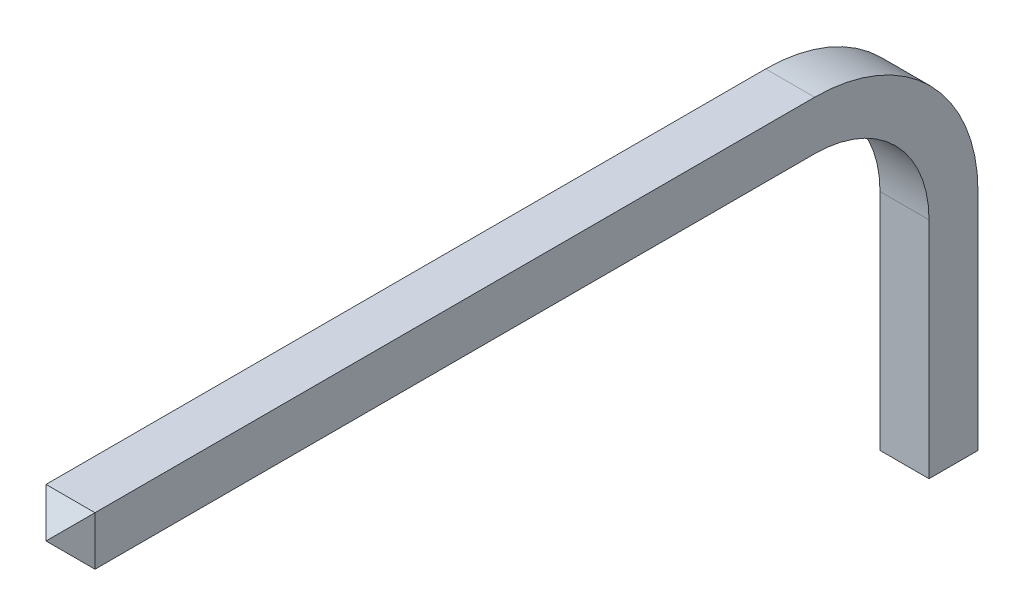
ISO-10303-21;
HEADER;
FILE_DESCRIPTION(('STEP AP214'),'2;1');
FILE_NAME('part.step','',(''),(''),'','','');
FILE_SCHEMA(('AUTOMOTIVE_DESIGN { 1 0 10303 214 1 1 1 1 }'));
ENDSEC;
DATA;
#1=APPLICATION_CONTEXT('core data for automotive mechanical design processes');
#2=APPLICATION_PROTOCOL_DEFINITION('international standard','automotive_design',2000,#1);
#3=PRODUCT_CONTEXT('',#1,'mechanical');
#4=PRODUCT('Part','Part','',(#3));
#5=PRODUCT_RELATED_PRODUCT_CATEGORY('part','',(#4));
#6=PRODUCT_DEFINITION_FORMATION('','',#4);
#7=PRODUCT_DEFINITION_CONTEXT('part definition',#1,'design');
#8=PRODUCT_DEFINITION('design','',#6,#7);
#9=PRODUCT_DEFINITION_SHAPE('','',#8);
#10=(LENGTH_UNIT() NAMED_UNIT(*) SI_UNIT(.MILLI.,.METRE.));
#11=(NAMED_UNIT(*) PLANE_ANGLE_UNIT() SI_UNIT($,.RADIAN.));
#12=(NAMED_UNIT(*) SI_UNIT($,.STERADIAN.) SOLID_ANGLE_UNIT());
#13=UNCERTAINTY_MEASURE_WITH_UNIT(LENGTH_MEASURE(1.E-05),#10,'distance_accuracy_value','');
#14=(GEOMETRIC_REPRESENTATION_CONTEXT(3) GLOBAL_UNCERTAINTY_ASSIGNED_CONTEXT((#13)) GLOBAL_UNIT_ASSIGNED_CONTEXT((#10,
#11,#12)) REPRESENTATION_CONTEXT('',''));
#15=CARTESIAN_POINT('',(0.,0.,0.));
#16=DIRECTION('',(0.,0.,1.));
#17=DIRECTION('',(1.,0.,0.));
#18=AXIS2_PLACEMENT_3D('',#15,#16,#17);
#19=CARTESIAN_POINT('',(0.5715,9.0424,3.81000000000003));
#20=DIRECTION('',(0.,-1.,0.));
#21=DIRECTION('',(0.,0.,-1.));
#22=AXIS2_PLACEMENT_3D('',#19,#20,#21);
#23=PLANE('',#22);
#24=DIRECTION('',(0.,0.,1.));
#25=VECTOR('',#24,1.);
#26=CARTESIAN_POINT('',(-0.5715,9.0424,3.81000000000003));
#27=LINE('',#26,#25);
#28=CARTESIAN_POINT('',(-0.5715,9.0424,3.81000000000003));
#29=VERTEX_POINT('',#28);
#30=CARTESIAN_POINT('',(-0.5715,9.0424,20.5994));
#31=VERTEX_POINT('',#30);
#32=EDGE_CURVE('E179',#29,#31,#27,.T.);
#33=ORIENTED_EDGE('',*,*,#32,.T.);
#34=DIRECTION('',(-1.,0.,0.));
#35=VECTOR('',#34,1.);
#36=CARTESIAN_POINT('',(0.5715,9.0424,20.5994));
#37=LINE('',#36,#35);
#38=CARTESIAN_POINT('',(0.5715,9.0424,20.5994));
#39=VERTEX_POINT('',#38);
#40=EDGE_CURVE('E11',#39,#31,#37,.T.);
#41=ORIENTED_EDGE('',*,*,#40,.F.);
#42=DIRECTION('',(0.,0.,1.));
#43=VECTOR('',#42,1.);
#44=CARTESIAN_POINT('',(0.5715,9.0424,3.81000000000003));
#45=LINE('',#44,#43);
#46=CARTESIAN_POINT('',(0.5715,9.0424,3.81000000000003));
#47=VERTEX_POINT('',#46);
#48=EDGE_CURVE('E84',#47,#39,#45,.T.);
#49=ORIENTED_EDGE('',*,*,#48,.F.);
#50=DIRECTION('',(-1.,0.,0.));
#51=VECTOR('',#50,1.);
#52=CARTESIAN_POINT('',(0.5715,9.0424,3.81000000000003));
#53=LINE('',#52,#51);
#54=EDGE_CURVE('E136',#47,#29,#53,.T.);
#55=ORIENTED_EDGE('',*,*,#54,.T.);
#56=EDGE_LOOP('',(#33,#41,#49,#55));
#57=FACE_BOUND('',#56,.T.);
#58=ADVANCED_FACE('F33',(#57),#23,.F.);
#59=CARTESIAN_POINT('',(0.5715,7.8994,3.81000000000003));
#60=DIRECTION('',(0.,-1.,0.));
#61=DIRECTION('',(0.,0.,-1.));
#62=AXIS2_PLACEMENT_3D('',#59,#60,#61);
#63=PLANE('',#62);
#64=DIRECTION('',(0.,0.,1.));
#65=VECTOR('',#64,1.);
#66=CARTESIAN_POINT('',(-0.5715,7.8994,3.81000000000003));
#67=LINE('',#66,#65);
#68=CARTESIAN_POINT('',(-0.5715,7.8994,3.81000000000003));
#69=VERTEX_POINT('',#68);
#70=CARTESIAN_POINT('',(-0.5715,7.8994,20.5994));
#71=VERTEX_POINT('',#70);
#72=EDGE_CURVE('E148',#69,#71,#67,.T.);
#73=ORIENTED_EDGE('',*,*,#72,.F.);
#74=DIRECTION('',(-1.,0.,0.));
#75=VECTOR('',#74,1.);
#76=CARTESIAN_POINT('',(0.5715,7.8994,3.81000000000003));
#77=LINE('',#76,#75);
#78=CARTESIAN_POINT('',(0.5715,7.8994,3.81000000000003));
#79=VERTEX_POINT('',#78);
#80=EDGE_CURVE('E141',#79,#69,#77,.T.);
#81=ORIENTED_EDGE('',*,*,#80,.F.);
#82=DIRECTION('',(0.,0.,1.));
#83=VECTOR('',#82,1.);
#84=CARTESIAN_POINT('',(0.5715,7.8994,3.81000000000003));
#85=LINE('',#84,#83);
#86=CARTESIAN_POINT('',(0.5715,7.8994,20.5994));
#87=VERTEX_POINT('',#86);
#88=EDGE_CURVE('E151',#79,#87,#85,.T.);
#89=ORIENTED_EDGE('',*,*,#88,.T.);
#90=DIRECTION('',(-1.,0.,0.));
#91=VECTOR('',#90,1.);
#92=CARTESIAN_POINT('',(0.5715,7.8994,20.5994));
#93=LINE('',#92,#91);
#94=EDGE_CURVE('E41',#87,#71,#93,.T.);
#95=ORIENTED_EDGE('',*,*,#94,.T.);
#96=EDGE_LOOP('',(#73,#81,#89,#95));
#97=FACE_BOUND('',#96,.T.);
#98=ADVANCED_FACE('F147',(#97),#63,.T.);
#99=CARTESIAN_POINT('',(0.5715,5.2324,3.81));
#100=DIRECTION('',(-1.,0.,0.));
#101=DIRECTION('',(0.,0.,1.));
#102=AXIS2_PLACEMENT_3D('',#99,#100,#101);
#103=CYLINDRICAL_SURFACE('',#102,2.667);
#104=CARTESIAN_POINT('',(-0.5715,5.2324,3.81));
#105=DIRECTION('',(1.,0.,0.));
#106=DIRECTION('',(0.,0.,-1.));
#107=AXIS2_PLACEMENT_3D('',#104,#105,#106);
#108=CIRCLE('',#107,2.667);
#109=CARTESIAN_POINT('',(-0.5715,5.23239999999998,1.143));
#110=VERTEX_POINT('',#109);
#111=EDGE_CURVE('E166',#110,#69,#108,.T.);
#112=ORIENTED_EDGE('',*,*,#111,.F.);
#113=DIRECTION('',(-1.,0.,0.));
#114=VECTOR('',#113,1.);
#115=CARTESIAN_POINT('',(0.5715,5.23239999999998,1.143));
#116=LINE('',#115,#114);
#117=CARTESIAN_POINT('',(0.5715,5.23239999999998,1.143));
#118=VERTEX_POINT('',#117);
#119=EDGE_CURVE('E134',#118,#110,#116,.T.);
#120=ORIENTED_EDGE('',*,*,#119,.F.);
#121=CARTESIAN_POINT('',(0.5715,5.2324,3.81));
#122=DIRECTION('',(1.,0.,0.));
#123=DIRECTION('',(0.,0.,-1.));
#124=AXIS2_PLACEMENT_3D('',#121,#122,#123);
#125=CIRCLE('',#124,2.667);
#126=EDGE_CURVE('E194',#118,#79,#125,.T.);
#127=ORIENTED_EDGE('',*,*,#126,.T.);
#128=ORIENTED_EDGE('',*,*,#80,.T.);
#129=EDGE_LOOP('',(#112,#120,#127,#128));
#130=FACE_BOUND('',#129,.T.);
#131=ADVANCED_FACE('F226',(#130),#103,.F.);
#132=CARTESIAN_POINT('',(0.5715,0.,1.143));
#133=DIRECTION('',(0.,0.,1.));
#134=DIRECTION('',(1.,0.,0.));
#135=AXIS2_PLACEMENT_3D('',#132,#133,#134);
#136=PLANE('',#135);
#137=DIRECTION('',(0.,1.,0.));
#138=VECTOR('',#137,1.);
#139=CARTESIAN_POINT('',(-0.5715,0.,1.143));
#140=LINE('',#139,#138);
#141=CARTESIAN_POINT('',(-0.5715,0.,1.143));
#142=VERTEX_POINT('',#141);
#143=EDGE_CURVE('E185',#142,#110,#140,.T.);
#144=ORIENTED_EDGE('',*,*,#143,.F.);
#145=DIRECTION('',(-1.,0.,0.));
#146=VECTOR('',#145,1.);
#147=CARTESIAN_POINT('',(0.5715,0.,1.143));
#148=LINE('',#147,#146);
#149=CARTESIAN_POINT('',(0.5715,0.,1.143));
#150=VERTEX_POINT('',#149);
#151=EDGE_CURVE('E131',#150,#142,#148,.T.);
#152=ORIENTED_EDGE('',*,*,#151,.F.);
#153=DIRECTION('',(0.,1.,0.));
#154=VECTOR('',#153,1.);
#155=CARTESIAN_POINT('',(0.5715,0.,1.143));
#156=LINE('',#155,#154);
#157=EDGE_CURVE('E113',#150,#118,#156,.T.);
#158=ORIENTED_EDGE('',*,*,#157,.T.);
#159=ORIENTED_EDGE('',*,*,#119,.T.);
#160=EDGE_LOOP('',(#144,#152,#158,#159));
#161=FACE_BOUND('',#160,.T.);
#162=ADVANCED_FACE('F219',(#161),#136,.T.);
#163=CARTESIAN_POINT('',(0.5715,0.,0.));
#164=DIRECTION('',(0.,0.,1.));
#165=DIRECTION('',(1.,0.,0.));
#166=AXIS2_PLACEMENT_3D('',#163,#164,#165);
#167=PLANE('',#166);
#168=DIRECTION('',(0.,1.,0.));
#169=VECTOR('',#168,1.);
#170=CARTESIAN_POINT('',(-0.5715,0.,0.));
#171=LINE('',#170,#169);
#172=CARTESIAN_POINT('',(-0.5715,0.,0.));
#173=VERTEX_POINT('',#172);
#174=CARTESIAN_POINT('',(-0.5715,5.23239999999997,0.));
#175=VERTEX_POINT('',#174);
#176=EDGE_CURVE('E72',#173,#175,#171,.T.);
#177=ORIENTED_EDGE('',*,*,#176,.T.);
#178=DIRECTION('',(-1.,0.,0.));
#179=VECTOR('',#178,1.);
#180=CARTESIAN_POINT('',(0.5715,5.23239999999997,0.));
#181=LINE('',#180,#179);
#182=CARTESIAN_POINT('',(0.5715,5.23239999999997,0.));
#183=VERTEX_POINT('',#182);
#184=EDGE_CURVE('E104',#183,#175,#181,.T.);
#185=ORIENTED_EDGE('',*,*,#184,.F.);
#186=DIRECTION('',(0.,1.,0.));
#187=VECTOR('',#186,1.);
#188=CARTESIAN_POINT('',(0.5715,0.,0.));
#189=LINE('',#188,#187);
#190=CARTESIAN_POINT('',(0.5715,0.,0.));
#191=VERTEX_POINT('',#190);
#192=EDGE_CURVE('E99',#191,#183,#189,.T.);
#193=ORIENTED_EDGE('',*,*,#192,.F.);
#194=DIRECTION('',(-1.,0.,0.));
#195=VECTOR('',#194,1.);
#196=CARTESIAN_POINT('',(0.5715,0.,0.));
#197=LINE('',#196,#195);
#198=EDGE_CURVE('E103',#191,#173,#197,.T.);
#199=ORIENTED_EDGE('',*,*,#198,.T.);
#200=EDGE_LOOP('',(#177,#185,#193,#199));
#201=FACE_BOUND('',#200,.T.);
#202=ADVANCED_FACE('F101',(#201),#167,.F.);
#203=CARTESIAN_POINT('',(0.5715,5.2324,3.81));
#204=DIRECTION('',(-1.,0.,0.));
#205=DIRECTION('',(0.,0.,1.));
#206=AXIS2_PLACEMENT_3D('',#203,#204,#205);
#207=CYLINDRICAL_SURFACE('',#206,3.81);
#208=CARTESIAN_POINT('',(-0.5715,5.2324,3.81));
#209=DIRECTION('',(1.,0.,0.));
#210=DIRECTION('',(0.,0.,-1.));
#211=AXIS2_PLACEMENT_3D('',#208,#209,#210);
#212=CIRCLE('',#211,3.81);
#213=EDGE_CURVE('E78',#175,#29,#212,.T.);
#214=ORIENTED_EDGE('',*,*,#213,.T.);
#215=ORIENTED_EDGE('',*,*,#54,.F.);
#216=CARTESIAN_POINT('',(0.5715,5.2324,3.81));
#217=DIRECTION('',(1.,0.,0.));
#218=DIRECTION('',(0.,0.,-1.));
#219=AXIS2_PLACEMENT_3D('',#216,#217,#218);
#220=CIRCLE('',#219,3.81);
#221=EDGE_CURVE('E49',#183,#47,#220,.T.);
#222=ORIENTED_EDGE('',*,*,#221,.F.);
#223=ORIENTED_EDGE('',*,*,#184,.T.);
#224=EDGE_LOOP('',(#214,#215,#222,#223));
#225=FACE_BOUND('',#224,.T.);
#226=ADVANCED_FACE('F294',(#225),#207,.T.);
#227=CARTESIAN_POINT('',(0.5715,5.2324,3.81));
#228=DIRECTION('',(1.,0.,0.));
#229=DIRECTION('',(0.,0.,-1.));
#230=AXIS2_PLACEMENT_3D('',#227,#228,#229);
#231=PLANE('',#230);
#232=ORIENTED_EDGE('',*,*,#48,.T.);
#233=DIRECTION('',(0.,1.,0.));
#234=VECTOR('',#233,1.);
#235=CARTESIAN_POINT('',(0.5715,7.8994,20.5994));
#236=LINE('',#235,#234);
#237=EDGE_CURVE('E198',#87,#39,#236,.T.);
#238=ORIENTED_EDGE('',*,*,#237,.F.);
#239=ORIENTED_EDGE('',*,*,#88,.F.);
#240=ORIENTED_EDGE('',*,*,#126,.F.);
#241=ORIENTED_EDGE('',*,*,#157,.F.);
#242=DIRECTION('',(0.,0.,1.));
#243=VECTOR('',#242,1.);
#244=CARTESIAN_POINT('',(0.5715,0.,0.));
#245=LINE('',#244,#243);
#246=EDGE_CURVE('E105',#191,#150,#245,.T.);
#247=ORIENTED_EDGE('',*,*,#246,.F.);
#248=ORIENTED_EDGE('',*,*,#192,.T.);
#249=ORIENTED_EDGE('',*,*,#221,.T.);
#250=EDGE_LOOP('',(#232,#238,#239,#240,#241,#247,#248,#249));
#251=FACE_BOUND('',#250,.T.);
#252=ADVANCED_FACE('F110',(#251),#231,.T.);
#253=CARTESIAN_POINT('',(-0.5715,5.2324,3.81));
#254=DIRECTION('',(1.,0.,0.));
#255=DIRECTION('',(0.,0.,-1.));
#256=AXIS2_PLACEMENT_3D('',#253,#254,#255);
#257=PLANE('',#256);
#258=ORIENTED_EDGE('',*,*,#32,.F.);
#259=ORIENTED_EDGE('',*,*,#213,.F.);
#260=ORIENTED_EDGE('',*,*,#176,.F.);
#261=DIRECTION('',(0.,0.,1.));
#262=VECTOR('',#261,1.);
#263=CARTESIAN_POINT('',(-0.5715,0.,0.));
#264=LINE('',#263,#262);
#265=EDGE_CURVE('E187',#173,#142,#264,.T.);
#266=ORIENTED_EDGE('',*,*,#265,.T.);
#267=ORIENTED_EDGE('',*,*,#143,.T.);
#268=ORIENTED_EDGE('',*,*,#111,.T.);
#269=ORIENTED_EDGE('',*,*,#72,.T.);
#270=DIRECTION('',(0.,1.,0.));
#271=VECTOR('',#270,1.);
#272=CARTESIAN_POINT('',(-0.5715,7.8994,20.5994));
#273=LINE('',#272,#271);
#274=EDGE_CURVE('E162',#71,#31,#273,.T.);
#275=ORIENTED_EDGE('',*,*,#274,.T.);
#276=EDGE_LOOP('',(#258,#259,#260,#266,#267,#268,#269,#275));
#277=FACE_BOUND('',#276,.T.);
#278=ADVANCED_FACE('F159',(#277),#257,.F.);
#279=CARTESIAN_POINT('',(0.5715,9.0424,20.5994));
#280=DIRECTION('',(0.,0.707106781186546,0.707106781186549));
#281=DIRECTION('',(0.,-0.707106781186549,0.707106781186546));
#282=AXIS2_PLACEMENT_3D('',#279,#280,#281);
#283=PLANE('',#282);
#284=ORIENTED_EDGE('',*,*,#40,.T.);
#285=DIRECTION('',(-0.577350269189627,0.577350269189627,-0.577350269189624));
#286=VECTOR('',#285,1.);
#287=CARTESIAN_POINT('',(-0.5715,9.0424,20.5994));
#288=LINE('',#287,#286);
#289=CARTESIAN_POINT('',(0.,8.4709,21.1709));
#290=VERTEX_POINT('',#289);
#291=EDGE_CURVE('E175',#290,#31,#288,.T.);
#292=ORIENTED_EDGE('',*,*,#291,.F.);
#293=DIRECTION('',(0.577350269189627,0.577350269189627,-0.577350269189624));
#294=VECTOR('',#293,1.);
#295=CARTESIAN_POINT('',(0.5715,9.0424,20.5994));
#296=LINE('',#295,#294);
#297=EDGE_CURVE('E203',#290,#39,#296,.T.);
#298=ORIENTED_EDGE('',*,*,#297,.T.);
#299=EDGE_LOOP('',(#284,#292,#298));
#300=FACE_BOUND('',#299,.T.);
#301=ADVANCED_FACE('F222',(#300),#283,.T.);
#302=CARTESIAN_POINT('',(-0.5715,9.0424,20.5994));
#303=DIRECTION('',(-0.707106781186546,0.,0.707106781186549));
#304=DIRECTION('',(0.707106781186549,0.,0.707106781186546));
#305=AXIS2_PLACEMENT_3D('',#302,#303,#304);
#306=PLANE('',#305);
#307=ORIENTED_EDGE('',*,*,#274,.F.);
#308=DIRECTION('',(-0.577350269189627,-0.577350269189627,-0.577350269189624));
#309=VECTOR('',#308,1.);
#310=CARTESIAN_POINT('',(-0.5715,7.8994,20.5994));
#311=LINE('',#310,#309);
#312=EDGE_CURVE('E169',#290,#71,#311,.T.);
#313=ORIENTED_EDGE('',*,*,#312,.F.);
#314=ORIENTED_EDGE('',*,*,#291,.T.);
#315=EDGE_LOOP('',(#307,#313,#314));
#316=FACE_BOUND('',#315,.T.);
#317=ADVANCED_FACE('F177',(#316),#306,.T.);
#318=CARTESIAN_POINT('',(-0.5715,7.8994,20.5994));
#319=DIRECTION('',(0.,-0.707106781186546,0.707106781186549));
#320=DIRECTION('',(0.,-0.707106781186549,-0.707106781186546));
#321=AXIS2_PLACEMENT_3D('',#318,#319,#320);
#322=PLANE('',#321);
#323=ORIENTED_EDGE('',*,*,#94,.F.);
#324=DIRECTION('',(0.577350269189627,-0.577350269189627,-0.577350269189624));
#325=VECTOR('',#324,1.);
#326=CARTESIAN_POINT('',(0.5715,7.8994,20.5994));
#327=LINE('',#326,#325);
#328=EDGE_CURVE('E171',#290,#87,#327,.T.);
#329=ORIENTED_EDGE('',*,*,#328,.F.);
#330=ORIENTED_EDGE('',*,*,#312,.T.);
#331=EDGE_LOOP('',(#323,#329,#330));
#332=FACE_BOUND('',#331,.T.);
#333=ADVANCED_FACE('F170',(#332),#322,.T.);
#334=CARTESIAN_POINT('',(0.5715,7.8994,20.5994));
#335=DIRECTION('',(0.707106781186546,0.,0.707106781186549));
#336=DIRECTION('',(0.707106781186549,0.,-0.707106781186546));
#337=AXIS2_PLACEMENT_3D('',#334,#335,#336);
#338=PLANE('',#337);
#339=ORIENTED_EDGE('',*,*,#237,.T.);
#340=ORIENTED_EDGE('',*,*,#297,.F.);
#341=ORIENTED_EDGE('',*,*,#328,.T.);
#342=EDGE_LOOP('',(#339,#340,#341));
#343=FACE_BOUND('',#342,.T.);
#344=ADVANCED_FACE('F224',(#343),#338,.T.);
#345=CARTESIAN_POINT('',(0.5715,0.,1.143));
#346=DIRECTION('',(0.,-0.707106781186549,0.707106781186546));
#347=DIRECTION('',(0.,-0.707106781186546,-0.707106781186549));
#348=AXIS2_PLACEMENT_3D('',#345,#346,#347);
#349=PLANE('',#348);
#350=ORIENTED_EDGE('',*,*,#151,.T.);
#351=DIRECTION('',(-0.577350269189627,0.577350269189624,0.577350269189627));
#352=VECTOR('',#351,1.);
#353=CARTESIAN_POINT('',(-0.5715,0.,1.143));
#354=LINE('',#353,#352);
#355=CARTESIAN_POINT('',(0.,-0.571499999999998,0.5715));
#356=VERTEX_POINT('',#355);
#357=EDGE_CURVE('E206',#356,#142,#354,.T.);
#358=ORIENTED_EDGE('',*,*,#357,.F.);
#359=DIRECTION('',(0.577350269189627,0.577350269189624,0.577350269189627));
#360=VECTOR('',#359,1.);
#361=CARTESIAN_POINT('',(0.5715,0.,1.143));
#362=LINE('',#361,#360);
#363=EDGE_CURVE('E122',#356,#150,#362,.T.);
#364=ORIENTED_EDGE('',*,*,#363,.T.);
#365=EDGE_LOOP('',(#350,#358,#364));
#366=FACE_BOUND('',#365,.T.);
#367=ADVANCED_FACE('F216',(#366),#349,.T.);
#368=CARTESIAN_POINT('',(-0.5715,0.,1.143));
#369=DIRECTION('',(-0.707106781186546,-0.707106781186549,0.));
#370=DIRECTION('',(0.707106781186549,-0.707106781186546,0.));
#371=AXIS2_PLACEMENT_3D('',#368,#369,#370);
#372=PLANE('',#371);
#373=ORIENTED_EDGE('',*,*,#265,.F.);
#374=DIRECTION('',(-0.577350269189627,0.577350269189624,-0.577350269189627));
#375=VECTOR('',#374,1.);
#376=CARTESIAN_POINT('',(-0.5715,0.,0.));
#377=LINE('',#376,#375);
#378=EDGE_CURVE('E126',#356,#173,#377,.T.);
#379=ORIENTED_EDGE('',*,*,#378,.F.);
#380=ORIENTED_EDGE('',*,*,#357,.T.);
#381=EDGE_LOOP('',(#373,#379,#380));
#382=FACE_BOUND('',#381,.T.);
#383=ADVANCED_FACE('F213',(#382),#372,.T.);
#384=CARTESIAN_POINT('',(-0.5715,0.,0.));
#385=DIRECTION('',(0.,-0.707106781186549,-0.707106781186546));
#386=DIRECTION('',(0.,0.707106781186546,-0.707106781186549));
#387=AXIS2_PLACEMENT_3D('',#384,#385,#386);
#388=PLANE('',#387);
#389=ORIENTED_EDGE('',*,*,#198,.F.);
#390=DIRECTION('',(0.577350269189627,0.577350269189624,-0.577350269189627));
#391=VECTOR('',#390,1.);
#392=CARTESIAN_POINT('',(0.5715,0.,0.));
#393=LINE('',#392,#391);
#394=EDGE_CURVE('E119',#356,#191,#393,.T.);
#395=ORIENTED_EDGE('',*,*,#394,.F.);
#396=ORIENTED_EDGE('',*,*,#378,.T.);
#397=EDGE_LOOP('',(#389,#395,#396));
#398=FACE_BOUND('',#397,.T.);
#399=ADVANCED_FACE('F128',(#398),#388,.T.);
#400=CARTESIAN_POINT('',(0.5715,0.,0.));
#401=DIRECTION('',(0.707106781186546,-0.707106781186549,0.));
#402=DIRECTION('',(0.707106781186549,0.707106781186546,0.));
#403=AXIS2_PLACEMENT_3D('',#400,#401,#402);
#404=PLANE('',#403);
#405=ORIENTED_EDGE('',*,*,#246,.T.);
#406=ORIENTED_EDGE('',*,*,#363,.F.);
#407=ORIENTED_EDGE('',*,*,#394,.T.);
#408=EDGE_LOOP('',(#405,#406,#407));
#409=FACE_BOUND('',#408,.T.);
#410=ADVANCED_FACE('F120',(#409),#404,.T.);
#411=CLOSED_SHELL('',(#58,#98,#131,#162,#202,#226,#252,#278,#301,#317,#333,#344,#367,#383,#399,#410));
#412=MANIFOLD_SOLID_BREP('B2',#411);
#413=ADVANCED_BREP_SHAPE_REPRESENTATION('',(#18,#412),#14);
#414=SHAPE_DEFINITION_REPRESENTATION(#9,#413);
ENDSEC;
END-ISO-10303-21;
